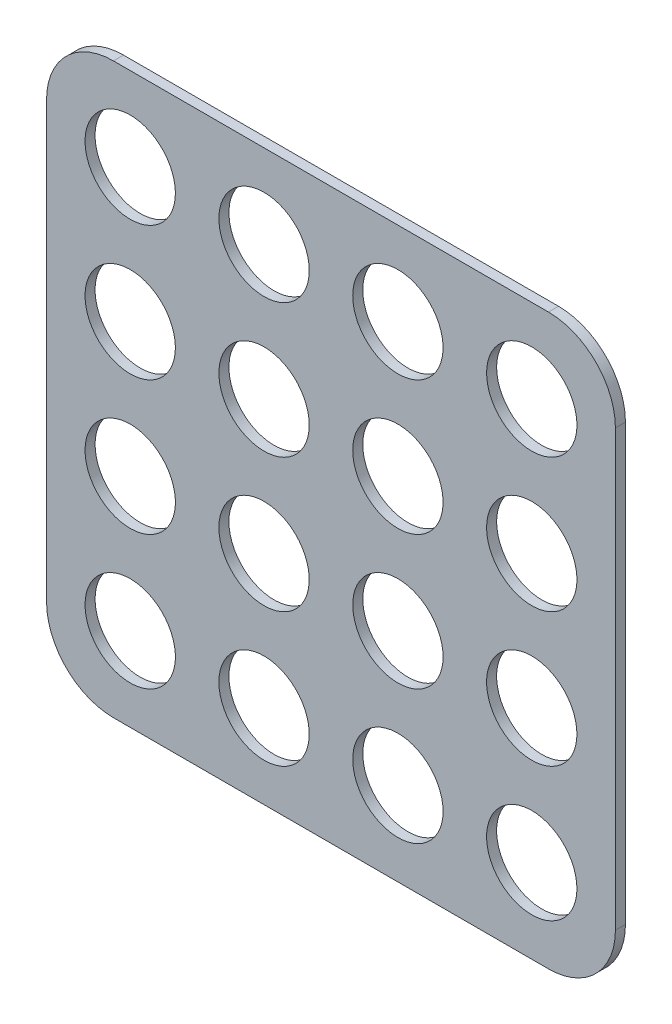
from build123d import *

# Parameters (mm, degrees)
ESQUISSE1_W             = 170
ESQUISSE1_H             = 170
BOSS_EXTRU_1_DEPTH      = 3
CONG_1_R                = 20
ESQUISSE2_R             = 13.5
ENL_V_MAT_EXTRU_1_DEPTH = 3


with BuildPart() as part:
    # Esquisse1 → Boss.-Extru.1 (new body)
    with BuildSketch(Plane.XY):
        with Locations((85, 85)):
            Rectangle(ESQUISSE1_W, ESQUISSE1_H)
    extrude(amount=BOSS_EXTRU_1_DEPTH)

    # Cong_1
    cong_1_edges = [part.edges().sort_by_distance(p)[0] for p in [
        (0, 170, 1.5),
        (170, 170, 1.5),
        (170, 0, 1.5),
        (0, 0, 1.5),
    ]]
    fillet(cong_1_edges, radius=CONG_1_R)

    # Esquisse2 → Enl_v. mat.-Extru.1 (cut)
    with BuildSketch(Plane.XY.offset(3)):
        with Locations((25, 145)):
            Circle(ESQUISSE2_R)
        with Locations((65, 145)):
            Circle(ESQUISSE2_R)
        with Locations((65, 105)):
            Circle(ESQUISSE2_R)
        with Locations((25, 105)):
            Circle(ESQUISSE2_R)
        with Locations(Location((105, 105, 0), (0, 0, 180))):
            Circle(ESQUISSE2_R)
        with Locations(Location((145, 105, 0), (0, 0, 180))):
            Circle(ESQUISSE2_R)
        with Locations(Location((105, 145, 0), (0, 0, 180))):
            Circle(ESQUISSE2_R)
        with Locations(Location((145, 145, 0), (0, 0, 180))):
            Circle(ESQUISSE2_R)
        with Locations((145, 65)):
            Circle(ESQUISSE2_R)
        with Locations((105, 65)):
            Circle(ESQUISSE2_R)
        with Locations(Location((25, 65, 0), (0, 0, 180))):
            Circle(ESQUISSE2_R)
        with Locations(Location((65, 65, 0), (0, 0, 180))):
            Circle(ESQUISSE2_R)
        with Locations((145, 25)):
            Circle(ESQUISSE2_R)
        with Locations((105, 25)):
            Circle(ESQUISSE2_R)
        with Locations(Location((65, 25, 0), (0, 0, 180))):
            Circle(ESQUISSE2_R)
        with Locations(Location((25, 25, 0), (0, 0, 180))):
            Circle(ESQUISSE2_R)
    extrude(amount=-ENL_V_MAT_EXTRU_1_DEPTH, mode=Mode.SUBTRACT)


solid = part.part
